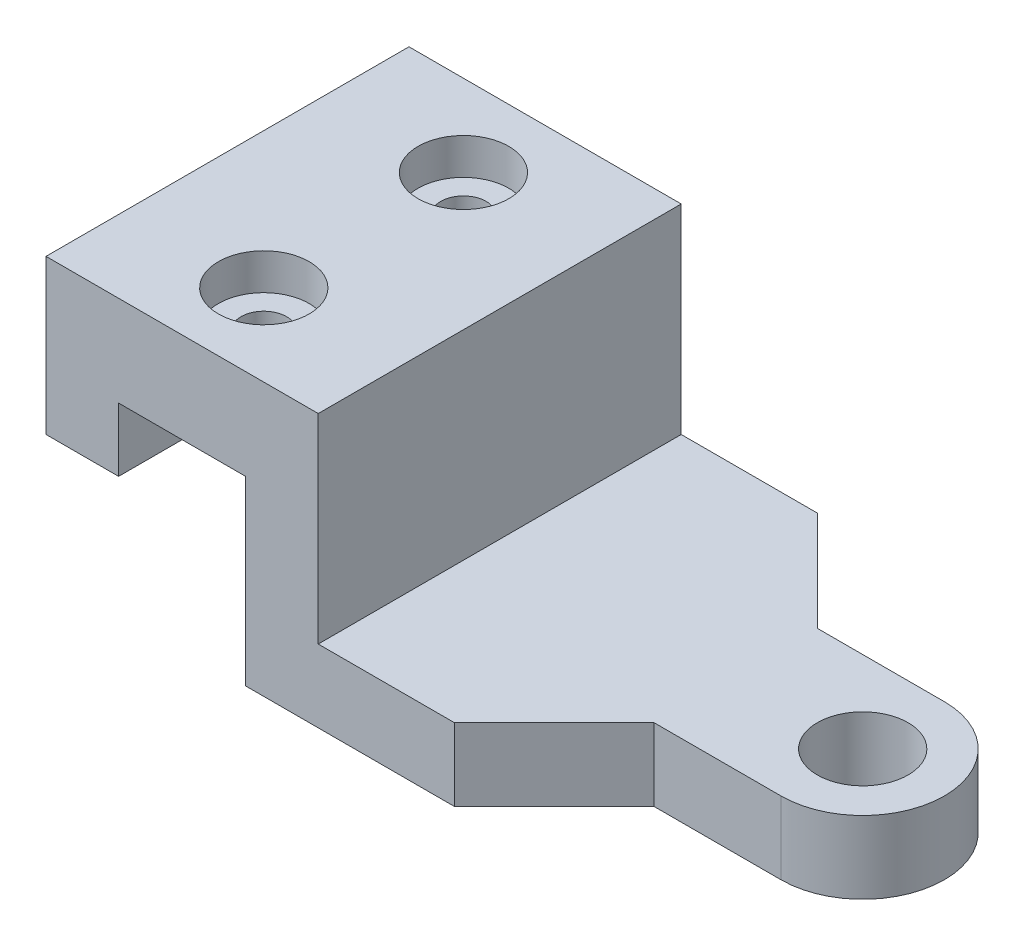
from build123d import *

# Parameters (mm, degrees)
SKETCH1_R                               = 25
BOSS_EXTRUDE1_DEPTH                     = 40
SKETCH1_3_W                             = 40
SKETCH1_3_H                             = 200
BOSS_EXTRUDE2_DEPTH                     = 150
SKETCH2_W                               = 200
SKETCH2_H                               = 50
BOSS_EXTRUDE3_DEPTH                     = 110
SKETCH3_W                               = 40
SKETCH3_H                               = 200
BOSS_EXTRUDE4_DEPTH                     = 35
CBORE_FOR_M5_HEX_HEAD_BOLT1_D           = 25
CBORE_FOR_M5_HEX_HEAD_BOLT1_CBORE_D     = 50
CBORE_FOR_M5_HEX_HEAD_BOLT1_CBORE_DEPTH = 20


with BuildPart() as part:
    # Sketch1 → Boss-Extrude1 (new body)
    with BuildSketch(Plane(origin=(0, 0, 0), x_dir=(1, 0, 0), z_dir=(0, 1, 0))):
        with BuildLine():
            ThreePointArc((200, 145), (245, 100), (200, 55))
            Line((200, 55), (130, 55))
            Line((130, 55), (75, 0))
            Line((75, 0), (0, 0))
            Line((0, 0), (0, 200))
            Line((0, 200), (75, 200))
            Line((75, 200), (130, 145))
            Line((130, 145), (200, 145))
        make_face()
        with Locations(Location((200, 100, 0), (0, 0, 270))):
            Circle(SKETCH1_R, mode=Mode.SUBTRACT)
    extrude(amount=BOSS_EXTRUDE1_DEPTH)

    # Sketch1_3 → Boss-Extrude2 (add)
    with BuildSketch(Plane(origin=(0, 0, 0), x_dir=(1, 0, 0), z_dir=(0, 1, 0))):
        with Locations((-20, 100)):
            Rectangle(SKETCH1_3_W, SKETCH1_3_H)
    extrude(amount=BOSS_EXTRUDE2_DEPTH)

    # Sketch2 → Boss-Extrude3 (add)
    with BuildSketch(Plane.ZY.offset(40)):
        with Locations((-100, 125)):
            Rectangle(SKETCH2_W, SKETCH2_H)
    extrude(amount=BOSS_EXTRUDE3_DEPTH)

    # Sketch3 → Boss-Extrude4 (add)
    with BuildSketch(Plane.XZ.offset(-100)):
        with Locations((-130, -100)):
            Rectangle(SKETCH3_W, SKETCH3_H)
    extrude(amount=BOSS_EXTRUDE4_DEPTH)

    # CBORE for M5 Hex Head Bolt1 (through all)
    with Locations(Plane(origin=(0, 150, 0), x_dir=(1, 0, 0), z_dir=(0, 1, 0))):
        with Locations((-75, 155), (-75, 45)):
            CounterBoreHole(CBORE_FOR_M5_HEX_HEAD_BOLT1_D / 2, CBORE_FOR_M5_HEX_HEAD_BOLT1_CBORE_D / 2, CBORE_FOR_M5_HEX_HEAD_BOLT1_CBORE_DEPTH)


solid = part.part
